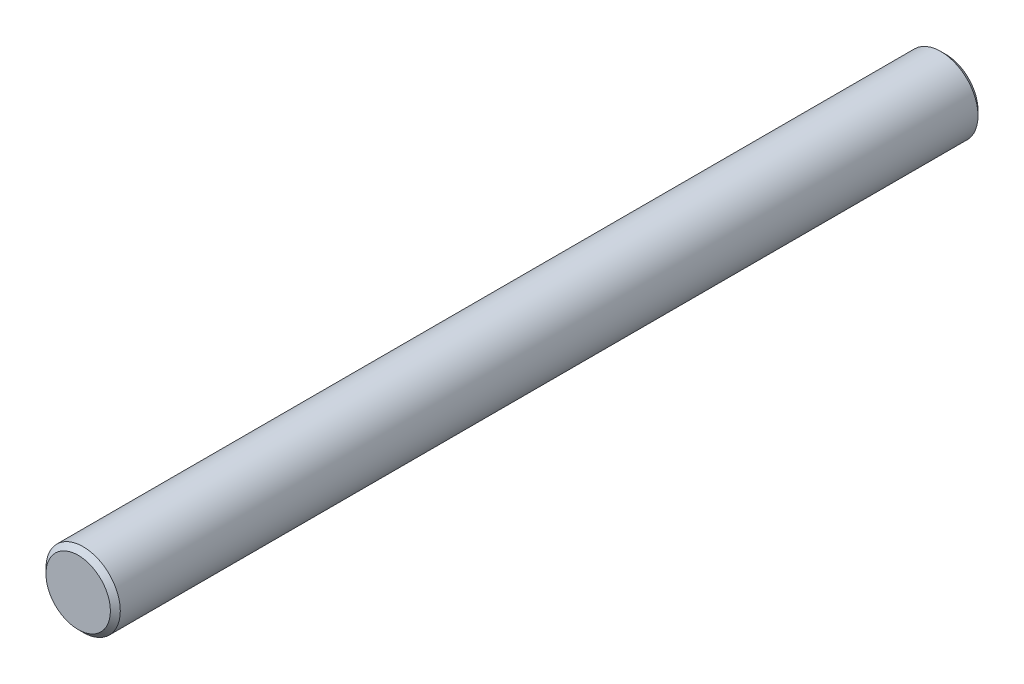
from build123d import *

# Parameters (mm, degrees)
ESQUISSE1_R        = 1.5
BOSS_EXTRU_1_DEPTH = 35
CHANFREIN1_SIZE    = 0.2


with BuildPart() as part:
    # Esquisse1 → Boss.-Extru.1 (new body)
    with BuildSketch(Plane.XY):
        Circle(ESQUISSE1_R)
    extrude(amount=BOSS_EXTRU_1_DEPTH)

    # Chanfrein1
    chanfrein1_edges = [part.edges().sort_by_distance(p)[0] for p in [
        (-1.5, 0, 0),
        (-1.5, 0, 35),
    ]]
    chamfer(chanfrein1_edges, length=CHANFREIN1_SIZE)


solid = part.part
